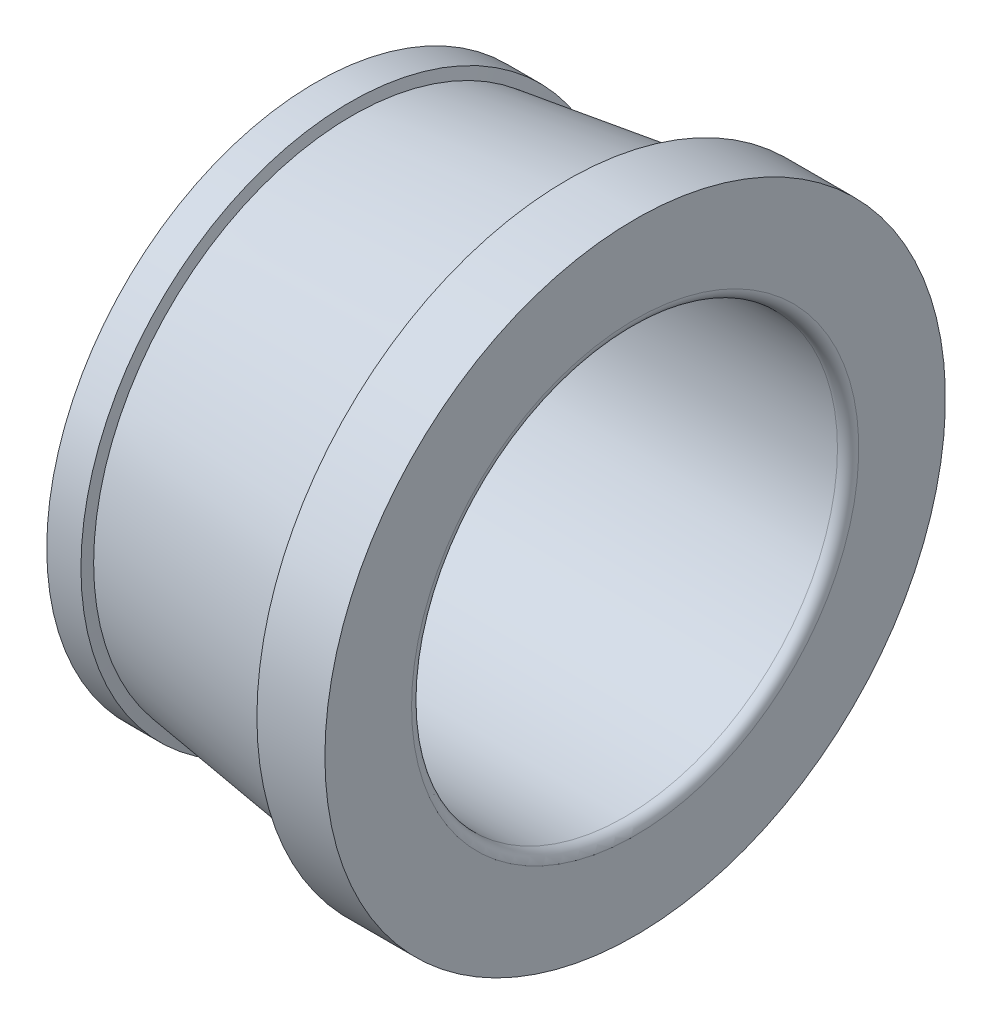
from build123d import *


with BuildPart() as part:
    # Esquisse1 → Base-R_volution (revolve)
    with BuildSketch(Plane(origin=(0, 0, 0), x_dir=(1, 0, 0), z_dir=(0, 1, 0)), mode=Mode.PRIVATE) as base_r_volution_sk:
        with BuildLine():
            Line((14.5, 10), (0.5, 10))
            ThreePointArc((0.5, 10), (0.146446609, 10.146446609), (0, 10.5))
            Line((0, 10.5), (0, 12.630990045))
            Line((0, 12.630990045), (1.604713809, 12.630990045))
            Line((1.604713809, 12.630990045), (1.701488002, 12.130990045))
            Line((1.701488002, 12.130990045), (12, 13.569932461))
            Line((12, 13.569932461), (11.806451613, 14.569932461))
            Line((11.806451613, 14.569932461), (15, 14.569932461))
            Line((15, 14.569932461), (15, 10.5))
            ThreePointArc((15, 10.5), (14.853553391, 10.146446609), (14.5, 10))
        make_face()
    revolve(base_r_volution_sk.sketch.rotate(Axis((0, 0, 0), (1, 0, 0)), 180), axis=Axis((0, 0, 0), (1, 0, 0)))


solid = part.part
